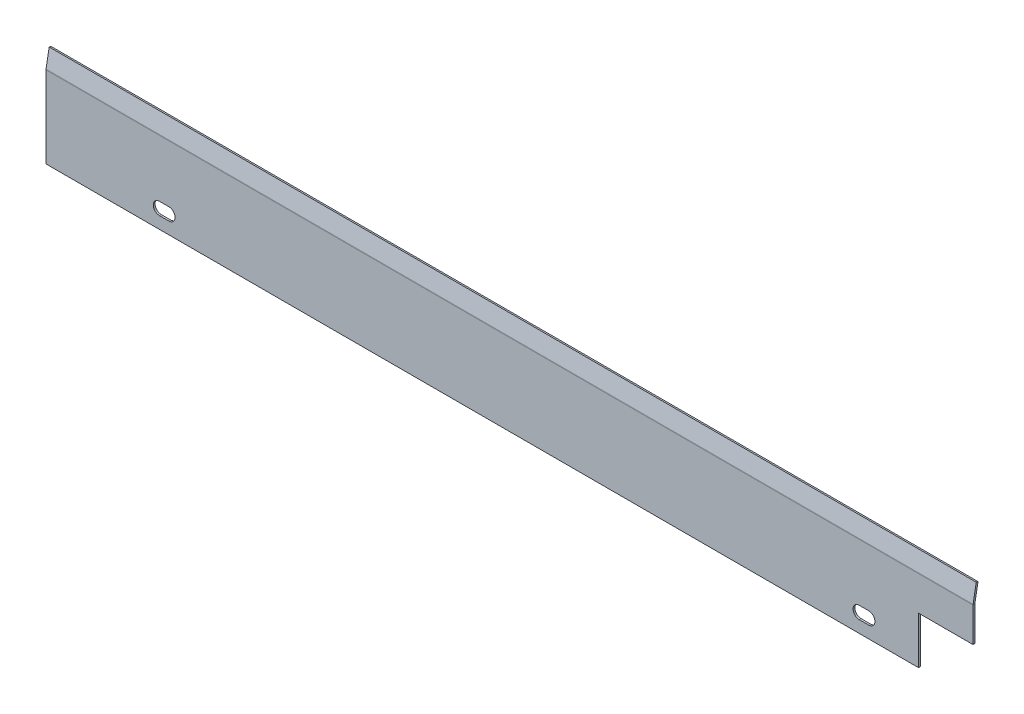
ISO-10303-21;
HEADER;
FILE_DESCRIPTION(('STEP AP214'),'2;1');
FILE_NAME('part.step','',(''),(''),'','','');
FILE_SCHEMA(('AUTOMOTIVE_DESIGN { 1 0 10303 214 1 1 1 1 }'));
ENDSEC;
DATA;
#1=APPLICATION_CONTEXT('core data for automotive mechanical design processes');
#2=APPLICATION_PROTOCOL_DEFINITION('international standard','automotive_design',2000,#1);
#3=PRODUCT_CONTEXT('',#1,'mechanical');
#4=PRODUCT('Part','Part','',(#3));
#5=PRODUCT_RELATED_PRODUCT_CATEGORY('part','',(#4));
#6=PRODUCT_DEFINITION_FORMATION('','',#4);
#7=PRODUCT_DEFINITION_CONTEXT('part definition',#1,'design');
#8=PRODUCT_DEFINITION('design','',#6,#7);
#9=PRODUCT_DEFINITION_SHAPE('','',#8);
#10=(LENGTH_UNIT() NAMED_UNIT(*) SI_UNIT(.MILLI.,.METRE.));
#11=(NAMED_UNIT(*) PLANE_ANGLE_UNIT() SI_UNIT($,.RADIAN.));
#12=(NAMED_UNIT(*) SI_UNIT($,.STERADIAN.) SOLID_ANGLE_UNIT());
#13=UNCERTAINTY_MEASURE_WITH_UNIT(LENGTH_MEASURE(1.E-05),#10,'distance_accuracy_value','');
#14=(GEOMETRIC_REPRESENTATION_CONTEXT(3) GLOBAL_UNCERTAINTY_ASSIGNED_CONTEXT((#13)) GLOBAL_UNIT_ASSIGNED_CONTEXT((#10,
#11,#12)) REPRESENTATION_CONTEXT('',''));
#15=CARTESIAN_POINT('',(0.,0.,0.));
#16=DIRECTION('',(0.,0.,1.));
#17=DIRECTION('',(1.,0.,0.));
#18=AXIS2_PLACEMENT_3D('',#15,#16,#17);
#19=CARTESIAN_POINT('',(255.,45.1723190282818,-0.0303844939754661));
#20=DIRECTION('',(1.,0.,0.));
#21=DIRECTION('',(0.,0.,-1.));
#22=AXIS2_PLACEMENT_3D('',#19,#20,#21);
#23=PLANE('',#22);
#24=DIRECTION('',(0.,-0.173648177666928,-0.984807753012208));
#25=VECTOR('',#24,1.);
#26=CARTESIAN_POINT('',(255.,45.1723190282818,-0.0303844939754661));
#27=LINE('',#26,#25);
#28=CARTESIAN_POINT('',(255.,45.1723190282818,-0.0303844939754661));
#29=VERTEX_POINT('',#28);
#30=CARTESIAN_POINT('',(255.,44.9986708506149,-1.01519224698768));
#31=VERTEX_POINT('',#30);
#32=EDGE_CURVE('E339',#29,#31,#27,.T.);
#33=ORIENTED_EDGE('',*,*,#32,.F.);
#34=CARTESIAN_POINT('',(255.,44.825022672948,-1.99999999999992));
#35=DIRECTION('',(1.,0.,0.));
#36=DIRECTION('',(0.,0.,-1.));
#37=AXIS2_PLACEMENT_3D('',#34,#35,#36);
#38=CIRCLE('',#37,2.);
#39=CARTESIAN_POINT('',(255.,44.825022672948,0.));
#40=VERTEX_POINT('',#39);
#41=EDGE_CURVE('E287',#40,#29,#38,.F.);
#42=ORIENTED_EDGE('',*,*,#41,.F.);
#43=DIRECTION('',(0.,0.,1.));
#44=VECTOR('',#43,1.);
#45=CARTESIAN_POINT('',(255.,44.825022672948,-0.999999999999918));
#46=LINE('',#45,#44);
#47=CARTESIAN_POINT('',(255.,44.825022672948,-0.999999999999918));
#48=VERTEX_POINT('',#47);
#49=EDGE_CURVE('E335',#48,#40,#46,.T.);
#50=ORIENTED_EDGE('',*,*,#49,.F.);
#51=CARTESIAN_POINT('',(255.,44.825022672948,-1.99999999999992));
#52=DIRECTION('',(1.,0.,0.));
#53=DIRECTION('',(0.,0.,-1.));
#54=AXIS2_PLACEMENT_3D('',#51,#52,#53);
#55=CIRCLE('',#54,1.);
#56=EDGE_CURVE('E297',#48,#31,#55,.F.);
#57=ORIENTED_EDGE('',*,*,#56,.T.);
#58=EDGE_LOOP('',(#33,#42,#50,#57));
#59=FACE_BOUND('',#58,.T.);
#60=ADVANCED_FACE('F38',(#59),#23,.T.);
#61=CARTESIAN_POINT('',(255.,44.825022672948,-0.999999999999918));
#62=DIRECTION('',(1.,0.,0.));
#63=DIRECTION('',(0.,0.,-1.));
#64=AXIS2_PLACEMENT_3D('',#61,#62,#63);
#65=PLANE('',#64);
#66=DIRECTION('',(0.,0.984807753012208,-0.17364817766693));
#67=VECTOR('',#66,1.);
#68=CARTESIAN_POINT('',(255.,45.,0.));
#69=LINE('',#68,#67);
#70=CARTESIAN_POINT('',(255.,54.8480775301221,-1.7364817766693));
#71=VERTEX_POINT('',#70);
#72=EDGE_CURVE('E283',#29,#71,#69,.T.);
#73=ORIENTED_EDGE('',*,*,#72,.F.);
#74=ORIENTED_EDGE('',*,*,#32,.T.);
#75=DIRECTION('',(0.,0.984807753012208,-0.17364817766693));
#76=VECTOR('',#75,1.);
#77=CARTESIAN_POINT('',(255.,44.8263518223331,-0.984807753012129));
#78=LINE('',#77,#76);
#79=CARTESIAN_POINT('',(255.,54.6744293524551,-2.72128952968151));
#80=VERTEX_POINT('',#79);
#81=EDGE_CURVE('E276',#31,#80,#78,.T.);
#82=ORIENTED_EDGE('',*,*,#81,.T.);
#83=DIRECTION('',(0.,-0.173648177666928,-0.984807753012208));
#84=VECTOR('',#83,1.);
#85=CARTESIAN_POINT('',(255.,54.8480775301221,-1.7364817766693));
#86=LINE('',#85,#84);
#87=EDGE_CURVE('E279',#71,#80,#86,.T.);
#88=ORIENTED_EDGE('',*,*,#87,.F.);
#89=EDGE_LOOP('',(#73,#74,#82,#88));
#90=FACE_BOUND('',#89,.T.);
#91=ADVANCED_FACE('F392',(#90),#65,.T.);
#92=CARTESIAN_POINT('',(-255.,44.8250226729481,0.));
#93=DIRECTION('',(-1.,0.,0.));
#94=DIRECTION('',(0.,0.,1.));
#95=AXIS2_PLACEMENT_3D('',#92,#93,#94);
#96=PLANE('',#95);
#97=DIRECTION('',(0.,0.,-1.));
#98=VECTOR('',#97,1.);
#99=CARTESIAN_POINT('',(-255.,44.8250226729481,0.));
#100=LINE('',#99,#98);
#101=CARTESIAN_POINT('',(-255.,44.8250226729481,0.));
#102=VERTEX_POINT('',#101);
#103=CARTESIAN_POINT('',(-255.,44.8250226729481,-0.999999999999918));
#104=VERTEX_POINT('',#103);
#105=EDGE_CURVE('E332',#102,#104,#100,.T.);
#106=ORIENTED_EDGE('',*,*,#105,.F.);
#107=CARTESIAN_POINT('',(-255.,44.8250226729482,-1.99999999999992));
#108=DIRECTION('',(1.,0.,0.));
#109=DIRECTION('',(0.,0.,-1.));
#110=AXIS2_PLACEMENT_3D('',#107,#108,#109);
#111=CIRCLE('',#110,2.);
#112=CARTESIAN_POINT('',(-255.,45.172319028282,-0.0303844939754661));
#113=VERTEX_POINT('',#112);
#114=EDGE_CURVE('E257',#102,#113,#111,.F.);
#115=ORIENTED_EDGE('',*,*,#114,.T.);
#116=DIRECTION('',(0.,0.173648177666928,0.984807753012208));
#117=VECTOR('',#116,1.);
#118=CARTESIAN_POINT('',(-255.,44.9986708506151,-1.01519224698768));
#119=LINE('',#118,#117);
#120=CARTESIAN_POINT('',(-255.,44.9986708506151,-1.01519224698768));
#121=VERTEX_POINT('',#120);
#122=EDGE_CURVE('E329',#121,#113,#119,.T.);
#123=ORIENTED_EDGE('',*,*,#122,.F.);
#124=CARTESIAN_POINT('',(-255.,44.8250226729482,-1.99999999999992));
#125=DIRECTION('',(1.,0.,0.));
#126=DIRECTION('',(0.,0.,-1.));
#127=AXIS2_PLACEMENT_3D('',#124,#125,#126);
#128=CIRCLE('',#127,1.);
#129=EDGE_CURVE('E272',#104,#121,#128,.F.);
#130=ORIENTED_EDGE('',*,*,#129,.F.);
#131=EDGE_LOOP('',(#106,#115,#123,#130));
#132=FACE_BOUND('',#131,.T.);
#133=ADVANCED_FACE('F397',(#132),#96,.T.);
#134=CARTESIAN_POINT('',(-255.,44.9986708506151,-1.01519224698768));
#135=DIRECTION('',(-1.,0.,0.));
#136=DIRECTION('',(0.,0.,1.));
#137=AXIS2_PLACEMENT_3D('',#134,#135,#136);
#138=PLANE('',#137);
#139=DIRECTION('',(0.,1.,0.));
#140=VECTOR('',#139,1.);
#141=CARTESIAN_POINT('',(-255.,1.66533453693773E-13,0.));
#142=LINE('',#141,#140);
#143=CARTESIAN_POINT('',(-255.,1.66533453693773E-13,0.));
#144=VERTEX_POINT('',#143);
#145=EDGE_CURVE('E261',#144,#102,#142,.T.);
#146=ORIENTED_EDGE('',*,*,#145,.T.);
#147=ORIENTED_EDGE('',*,*,#105,.T.);
#148=DIRECTION('',(0.,1.,0.));
#149=VECTOR('',#148,1.);
#150=CARTESIAN_POINT('',(-255.,1.66533453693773E-13,-1.));
#151=LINE('',#150,#149);
#152=CARTESIAN_POINT('',(-255.,1.66533453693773E-13,-1.));
#153=VERTEX_POINT('',#152);
#154=EDGE_CURVE('E268',#153,#104,#151,.T.);
#155=ORIENTED_EDGE('',*,*,#154,.F.);
#156=DIRECTION('',(0.,0.,1.));
#157=VECTOR('',#156,1.);
#158=CARTESIAN_POINT('',(-255.,1.66533453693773E-13,-1.));
#159=LINE('',#158,#157);
#160=EDGE_CURVE('E264',#153,#144,#159,.T.);
#161=ORIENTED_EDGE('',*,*,#160,.T.);
#162=EDGE_LOOP('',(#146,#147,#155,#161));
#163=FACE_BOUND('',#162,.T.);
#164=ADVANCED_FACE('F441',(#163),#138,.T.);
#165=CARTESIAN_POINT('',(255.,44.8263518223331,-0.984807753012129));
#166=DIRECTION('',(0.,0.17364817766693,0.984807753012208));
#167=DIRECTION('',(0.,-0.984807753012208,0.17364817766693));
#168=AXIS2_PLACEMENT_3D('',#165,#166,#167);
#169=PLANE('',#168);
#170=DIRECTION('',(0.,0.984807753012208,-0.17364817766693));
#171=VECTOR('',#170,1.);
#172=CARTESIAN_POINT('',(-255.,44.8263518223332,-0.984807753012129));
#173=LINE('',#172,#171);
#174=CARTESIAN_POINT('',(-255.,54.6744293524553,-2.72128952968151));
#175=VERTEX_POINT('',#174);
#176=EDGE_CURVE('E245',#121,#175,#173,.T.);
#177=ORIENTED_EDGE('',*,*,#176,.T.);
#178=DIRECTION('',(-1.,0.,0.));
#179=VECTOR('',#178,1.);
#180=CARTESIAN_POINT('',(255.,54.6744293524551,-2.72128952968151));
#181=LINE('',#180,#179);
#182=EDGE_CURVE('E326',#80,#175,#181,.T.);
#183=ORIENTED_EDGE('',*,*,#182,.F.);
#184=ORIENTED_EDGE('',*,*,#81,.F.);
#185=DIRECTION('',(-1.,0.,0.));
#186=VECTOR('',#185,1.);
#187=CARTESIAN_POINT('',(255.,44.9986708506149,-1.01519224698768));
#188=LINE('',#187,#186);
#189=EDGE_CURVE('E301',#31,#121,#188,.T.);
#190=ORIENTED_EDGE('',*,*,#189,.T.);
#191=EDGE_LOOP('',(#177,#183,#184,#190));
#192=FACE_BOUND('',#191,.T.);
#193=ADVANCED_FACE('F433',(#192),#169,.F.);
#194=CARTESIAN_POINT('',(255.,54.8480775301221,-1.7364817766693));
#195=DIRECTION('',(0.,0.984807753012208,-0.173648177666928));
#196=DIRECTION('',(0.,0.173648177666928,0.984807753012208));
#197=AXIS2_PLACEMENT_3D('',#194,#195,#196);
#198=PLANE('',#197);
#199=DIRECTION('',(0.,-0.173648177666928,-0.984807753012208));
#200=VECTOR('',#199,1.);
#201=CARTESIAN_POINT('',(-255.,54.8480775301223,-1.7364817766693));
#202=LINE('',#201,#200);
#203=CARTESIAN_POINT('',(-255.,54.8480775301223,-1.7364817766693));
#204=VERTEX_POINT('',#203);
#205=EDGE_CURVE('E249',#204,#175,#202,.T.);
#206=ORIENTED_EDGE('',*,*,#205,.F.);
#207=DIRECTION('',(-1.,0.,0.));
#208=VECTOR('',#207,1.);
#209=CARTESIAN_POINT('',(255.,54.8480775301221,-1.7364817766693));
#210=LINE('',#209,#208);
#211=EDGE_CURVE('E323',#71,#204,#210,.T.);
#212=ORIENTED_EDGE('',*,*,#211,.F.);
#213=ORIENTED_EDGE('',*,*,#87,.T.);
#214=ORIENTED_EDGE('',*,*,#182,.T.);
#215=EDGE_LOOP('',(#206,#212,#213,#214));
#216=FACE_BOUND('',#215,.T.);
#217=ADVANCED_FACE('F436',(#216),#198,.T.);
#218=CARTESIAN_POINT('',(255.,45.,0.));
#219=DIRECTION('',(0.,0.17364817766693,0.984807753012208));
#220=DIRECTION('',(0.,-0.984807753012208,0.17364817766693));
#221=AXIS2_PLACEMENT_3D('',#218,#219,#220);
#222=PLANE('',#221);
#223=DIRECTION('',(0.,0.984807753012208,-0.17364817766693));
#224=VECTOR('',#223,1.);
#225=CARTESIAN_POINT('',(-255.,45.0000000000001,0.));
#226=LINE('',#225,#224);
#227=EDGE_CURVE('E253',#113,#204,#226,.T.);
#228=ORIENTED_EDGE('',*,*,#227,.F.);
#229=DIRECTION('',(-1.,0.,0.));
#230=VECTOR('',#229,1.);
#231=CARTESIAN_POINT('',(255.,45.1723190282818,-0.0303844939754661));
#232=LINE('',#231,#230);
#233=EDGE_CURVE('E319',#29,#113,#232,.T.);
#234=ORIENTED_EDGE('',*,*,#233,.F.);
#235=ORIENTED_EDGE('',*,*,#72,.T.);
#236=ORIENTED_EDGE('',*,*,#211,.T.);
#237=EDGE_LOOP('',(#228,#234,#235,#236));
#238=FACE_BOUND('',#237,.T.);
#239=ADVANCED_FACE('F407',(#238),#222,.T.);
#240=CARTESIAN_POINT('',(255.,44.825022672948,-1.99999999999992));
#241=DIRECTION('',(-1.,0.,0.));
#242=DIRECTION('',(0.,0.,1.));
#243=AXIS2_PLACEMENT_3D('',#240,#241,#242);
#244=CYLINDRICAL_SURFACE('',#243,2.);
#245=ORIENTED_EDGE('',*,*,#114,.F.);
#246=DIRECTION('',(-1.,0.,0.));
#247=VECTOR('',#246,1.);
#248=CARTESIAN_POINT('',(255.,44.825022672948,0.));
#249=LINE('',#248,#247);
#250=EDGE_CURVE('E315',#40,#102,#249,.T.);
#251=ORIENTED_EDGE('',*,*,#250,.F.);
#252=ORIENTED_EDGE('',*,*,#41,.T.);
#253=ORIENTED_EDGE('',*,*,#233,.T.);
#254=EDGE_LOOP('',(#245,#251,#252,#253));
#255=FACE_BOUND('',#254,.T.);
#256=ADVANCED_FACE('F412',(#255),#244,.T.);
#257=CARTESIAN_POINT('',(255.,0.,0.));
#258=DIRECTION('',(0.,0.,1.));
#259=DIRECTION('',(1.,0.,0.));
#260=AXIS2_PLACEMENT_3D('',#257,#258,#259);
#261=PLANE('',#260);
#262=CARTESIAN_POINT('',(192.4,9.99999999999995,0.));
#263=DIRECTION('',(0.,0.,1.));
#264=DIRECTION('',(-1.,0.,0.));
#265=AXIS2_PLACEMENT_3D('',#262,#263,#264);
#266=CIRCLE('',#265,3.4);
#267=CARTESIAN_POINT('',(192.4,13.4,0.));
#268=VERTEX_POINT('',#267);
#269=CARTESIAN_POINT('',(192.4,6.59999999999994,0.));
#270=VERTEX_POINT('',#269);
#271=EDGE_CURVE('E53',#268,#270,#266,.T.);
#272=ORIENTED_EDGE('',*,*,#271,.F.);
#273=DIRECTION('',(-1.,0.,0.));
#274=VECTOR('',#273,1.);
#275=CARTESIAN_POINT('',(192.4,13.4,0.));
#276=LINE('',#275,#274);
#277=CARTESIAN_POINT('',(197.6,13.4,0.));
#278=VERTEX_POINT('',#277);
#279=EDGE_CURVE('E184',#278,#268,#276,.T.);
#280=ORIENTED_EDGE('',*,*,#279,.F.);
#281=CARTESIAN_POINT('',(197.6,9.99999999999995,0.));
#282=DIRECTION('',(0.,0.,1.));
#283=DIRECTION('',(1.,0.,0.));
#284=AXIS2_PLACEMENT_3D('',#281,#282,#283);
#285=CIRCLE('',#284,3.4);
#286=CARTESIAN_POINT('',(197.6,6.59999999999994,0.));
#287=VERTEX_POINT('',#286);
#288=EDGE_CURVE('E166',#287,#278,#285,.T.);
#289=ORIENTED_EDGE('',*,*,#288,.F.);
#290=DIRECTION('',(1.,0.,0.));
#291=VECTOR('',#290,1.);
#292=CARTESIAN_POINT('',(192.4,6.59999999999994,0.));
#293=LINE('',#292,#291);
#294=EDGE_CURVE('E176',#270,#287,#293,.T.);
#295=ORIENTED_EDGE('',*,*,#294,.F.);
#296=EDGE_LOOP('',(#272,#280,#289,#295));
#297=FACE_BOUND('',#296,.T.);
#298=CARTESIAN_POINT('',(-192.6,10.0000000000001,0.));
#299=DIRECTION('',(0.,0.,1.));
#300=DIRECTION('',(-1.,0.,0.));
#301=AXIS2_PLACEMENT_3D('',#298,#299,#300);
#302=CIRCLE('',#301,3.4);
#303=CARTESIAN_POINT('',(-192.6,13.4000000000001,0.));
#304=VERTEX_POINT('',#303);
#305=CARTESIAN_POINT('',(-192.6,6.60000000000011,0.));
#306=VERTEX_POINT('',#305);
#307=EDGE_CURVE('E196',#304,#306,#302,.T.);
#308=ORIENTED_EDGE('',*,*,#307,.F.);
#309=DIRECTION('',(-1.,0.,0.));
#310=VECTOR('',#309,1.);
#311=CARTESIAN_POINT('',(-192.6,13.4000000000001,0.));
#312=LINE('',#311,#310);
#313=CARTESIAN_POINT('',(-187.4,13.4000000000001,0.));
#314=VERTEX_POINT('',#313);
#315=EDGE_CURVE('E211',#314,#304,#312,.T.);
#316=ORIENTED_EDGE('',*,*,#315,.F.);
#317=CARTESIAN_POINT('',(-187.4,10.0000000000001,0.));
#318=DIRECTION('',(0.,0.,1.));
#319=DIRECTION('',(1.,0.,0.));
#320=AXIS2_PLACEMENT_3D('',#317,#318,#319);
#321=CIRCLE('',#320,3.4);
#322=CARTESIAN_POINT('',(-187.4,6.60000000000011,0.));
#323=VERTEX_POINT('',#322);
#324=EDGE_CURVE('E207',#323,#314,#321,.T.);
#325=ORIENTED_EDGE('',*,*,#324,.F.);
#326=DIRECTION('',(1.,0.,0.));
#327=VECTOR('',#326,1.);
#328=CARTESIAN_POINT('',(-192.6,6.60000000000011,0.));
#329=LINE('',#328,#327);
#330=EDGE_CURVE('E203',#306,#323,#329,.T.);
#331=ORIENTED_EDGE('',*,*,#330,.F.);
#332=EDGE_LOOP('',(#308,#316,#325,#331));
#333=FACE_BOUND('',#332,.T.);
#334=DIRECTION('',(0.,-1.,0.));
#335=VECTOR('',#334,1.);
#336=CARTESIAN_POINT('',(225.,0.,0.));
#337=LINE('',#336,#335);
#338=CARTESIAN_POINT('',(225.,26.,0.));
#339=VERTEX_POINT('',#338);
#340=CARTESIAN_POINT('',(225.,0.,0.));
#341=VERTEX_POINT('',#340);
#342=EDGE_CURVE('E231',#339,#341,#337,.T.);
#343=ORIENTED_EDGE('',*,*,#342,.F.);
#344=DIRECTION('',(-1.,0.,0.));
#345=VECTOR('',#344,1.);
#346=CARTESIAN_POINT('',(255.,26.,0.));
#347=LINE('',#346,#345);
#348=CARTESIAN_POINT('',(255.,26.,0.));
#349=VERTEX_POINT('',#348);
#350=EDGE_CURVE('E218',#349,#339,#347,.T.);
#351=ORIENTED_EDGE('',*,*,#350,.F.);
#352=DIRECTION('',(0.,1.,0.));
#353=VECTOR('',#352,1.);
#354=CARTESIAN_POINT('',(255.,0.,0.));
#355=LINE('',#354,#353);
#356=EDGE_CURVE('E291',#349,#40,#355,.T.);
#357=ORIENTED_EDGE('',*,*,#356,.T.);
#358=ORIENTED_EDGE('',*,*,#250,.T.);
#359=ORIENTED_EDGE('',*,*,#145,.F.);
#360=DIRECTION('',(-1.,0.,0.));
#361=VECTOR('',#360,1.);
#362=CARTESIAN_POINT('',(255.,0.,0.));
#363=LINE('',#362,#361);
#364=EDGE_CURVE('E312',#341,#144,#363,.T.);
#365=ORIENTED_EDGE('',*,*,#364,.F.);
#366=EDGE_LOOP('',(#343,#351,#357,#358,#359,#365));
#367=FACE_BOUND('',#366,.T.);
#368=ADVANCED_FACE('F181',(#297,#333,#367),#261,.T.);
#369=CARTESIAN_POINT('',(255.,0.,-1.));
#370=DIRECTION('',(0.,-1.,0.));
#371=DIRECTION('',(0.,0.,-1.));
#372=AXIS2_PLACEMENT_3D('',#369,#370,#371);
#373=PLANE('',#372);
#374=DIRECTION('',(0.,0.,1.));
#375=VECTOR('',#374,1.);
#376=CARTESIAN_POINT('',(225.,0.,-2.72128952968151));
#377=LINE('',#376,#375);
#378=CARTESIAN_POINT('',(225.,0.,-1.));
#379=VERTEX_POINT('',#378);
#380=EDGE_CURVE('E235',#379,#341,#377,.T.);
#381=ORIENTED_EDGE('',*,*,#380,.T.);
#382=ORIENTED_EDGE('',*,*,#364,.T.);
#383=ORIENTED_EDGE('',*,*,#160,.F.);
#384=DIRECTION('',(-1.,0.,0.));
#385=VECTOR('',#384,1.);
#386=CARTESIAN_POINT('',(255.,0.,-1.));
#387=LINE('',#386,#385);
#388=EDGE_CURVE('E309',#379,#153,#387,.T.);
#389=ORIENTED_EDGE('',*,*,#388,.F.);
#390=EDGE_LOOP('',(#381,#382,#383,#389));
#391=FACE_BOUND('',#390,.T.);
#392=ADVANCED_FACE('F445',(#391),#373,.T.);
#393=CARTESIAN_POINT('',(255.,0.,-1.));
#394=DIRECTION('',(0.,0.,1.));
#395=DIRECTION('',(1.,0.,0.));
#396=AXIS2_PLACEMENT_3D('',#393,#394,#395);
#397=PLANE('',#396);
#398=DIRECTION('',(-1.,0.,0.));
#399=VECTOR('',#398,1.);
#400=CARTESIAN_POINT('',(255.,13.3999999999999,-1.));
#401=LINE('',#400,#399);
#402=CARTESIAN_POINT('',(197.6,13.4,-1.));
#403=VERTEX_POINT('',#402);
#404=CARTESIAN_POINT('',(192.4,13.4,-1.));
#405=VERTEX_POINT('',#404);
#406=EDGE_CURVE('E46',#403,#405,#401,.T.);
#407=ORIENTED_EDGE('',*,*,#406,.T.);
#408=CARTESIAN_POINT('',(192.4,9.99999999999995,-1.));
#409=DIRECTION('',(0.,0.,1.));
#410=DIRECTION('',(1.,0.,0.));
#411=AXIS2_PLACEMENT_3D('',#408,#409,#410);
#412=CIRCLE('',#411,3.4);
#413=CARTESIAN_POINT('',(192.4,6.59999999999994,-1.));
#414=VERTEX_POINT('',#413);
#415=EDGE_CURVE('E11',#405,#414,#412,.T.);
#416=ORIENTED_EDGE('',*,*,#415,.T.);
#417=DIRECTION('',(1.,0.,0.));
#418=VECTOR('',#417,1.);
#419=CARTESIAN_POINT('',(255.,6.59999999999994,-1.));
#420=LINE('',#419,#418);
#421=CARTESIAN_POINT('',(197.6,6.59999999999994,-1.));
#422=VERTEX_POINT('',#421);
#423=EDGE_CURVE('E365',#414,#422,#420,.T.);
#424=ORIENTED_EDGE('',*,*,#423,.T.);
#425=CARTESIAN_POINT('',(197.6,9.99999999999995,-1.));
#426=DIRECTION('',(0.,0.,1.));
#427=DIRECTION('',(1.,0.,0.));
#428=AXIS2_PLACEMENT_3D('',#425,#426,#427);
#429=CIRCLE('',#428,3.4);
#430=EDGE_CURVE('E169',#422,#403,#429,.T.);
#431=ORIENTED_EDGE('',*,*,#430,.T.);
#432=EDGE_LOOP('',(#407,#416,#424,#431));
#433=FACE_BOUND('',#432,.T.);
#434=DIRECTION('',(-1.,0.,0.));
#435=VECTOR('',#434,1.);
#436=CARTESIAN_POINT('',(255.,13.3999999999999,-1.));
#437=LINE('',#436,#435);
#438=CARTESIAN_POINT('',(-187.4,13.4000000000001,-0.999999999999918));
#439=VERTEX_POINT('',#438);
#440=CARTESIAN_POINT('',(-192.6,13.4000000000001,-0.999999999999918));
#441=VERTEX_POINT('',#440);
#442=EDGE_CURVE('E357',#439,#441,#437,.T.);
#443=ORIENTED_EDGE('',*,*,#442,.T.);
#444=CARTESIAN_POINT('',(-192.6,10.0000000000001,-0.999999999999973));
#445=DIRECTION('',(0.,0.,1.));
#446=DIRECTION('',(1.,0.,0.));
#447=AXIS2_PLACEMENT_3D('',#444,#445,#446);
#448=CIRCLE('',#447,3.4);
#449=CARTESIAN_POINT('',(-192.6,6.60000000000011,-1.));
#450=VERTEX_POINT('',#449);
#451=EDGE_CURVE('E361',#441,#450,#448,.T.);
#452=ORIENTED_EDGE('',*,*,#451,.T.);
#453=DIRECTION('',(1.,0.,0.));
#454=VECTOR('',#453,1.);
#455=CARTESIAN_POINT('',(255.,6.59999999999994,-1.));
#456=LINE('',#455,#454);
#457=CARTESIAN_POINT('',(-187.4,6.60000000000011,-1.));
#458=VERTEX_POINT('',#457);
#459=EDGE_CURVE('E349',#450,#458,#456,.T.);
#460=ORIENTED_EDGE('',*,*,#459,.T.);
#461=CARTESIAN_POINT('',(-187.4,10.0000000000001,-0.999999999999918));
#462=DIRECTION('',(0.,0.,1.));
#463=DIRECTION('',(1.,0.,0.));
#464=AXIS2_PLACEMENT_3D('',#461,#462,#463);
#465=CIRCLE('',#464,3.4);
#466=EDGE_CURVE('E353',#458,#439,#465,.T.);
#467=ORIENTED_EDGE('',*,*,#466,.T.);
#468=EDGE_LOOP('',(#443,#452,#460,#467));
#469=FACE_BOUND('',#468,.T.);
#470=DIRECTION('',(-1.,0.,0.));
#471=VECTOR('',#470,1.);
#472=CARTESIAN_POINT('',(255.,26.,-1.));
#473=LINE('',#472,#471);
#474=CARTESIAN_POINT('',(255.,26.,-1.));
#475=VERTEX_POINT('',#474);
#476=CARTESIAN_POINT('',(225.,26.,-1.));
#477=VERTEX_POINT('',#476);
#478=EDGE_CURVE('E239',#475,#477,#473,.T.);
#479=ORIENTED_EDGE('',*,*,#478,.T.);
#480=DIRECTION('',(0.,-1.,0.));
#481=VECTOR('',#480,1.);
#482=CARTESIAN_POINT('',(225.,0.,-1.));
#483=LINE('',#482,#481);
#484=EDGE_CURVE('E345',#477,#379,#483,.T.);
#485=ORIENTED_EDGE('',*,*,#484,.T.);
#486=ORIENTED_EDGE('',*,*,#388,.T.);
#487=ORIENTED_EDGE('',*,*,#154,.T.);
#488=DIRECTION('',(-1.,0.,0.));
#489=VECTOR('',#488,1.);
#490=CARTESIAN_POINT('',(255.,44.825022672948,-0.999999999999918));
#491=LINE('',#490,#489);
#492=EDGE_CURVE('E305',#48,#104,#491,.T.);
#493=ORIENTED_EDGE('',*,*,#492,.F.);
#494=DIRECTION('',(0.,1.,0.));
#495=VECTOR('',#494,1.);
#496=CARTESIAN_POINT('',(255.,0.,-1.));
#497=LINE('',#496,#495);
#498=EDGE_CURVE('E294',#475,#48,#497,.T.);
#499=ORIENTED_EDGE('',*,*,#498,.F.);
#500=EDGE_LOOP('',(#479,#485,#486,#487,#493,#499));
#501=FACE_BOUND('',#500,.T.);
#502=ADVANCED_FACE('F372',(#433,#469,#501),#397,.F.);
#503=CARTESIAN_POINT('',(255.,44.825022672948,-1.99999999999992));
#504=DIRECTION('',(-1.,0.,0.));
#505=DIRECTION('',(0.,0.,1.));
#506=AXIS2_PLACEMENT_3D('',#503,#504,#505);
#507=CYLINDRICAL_SURFACE('',#506,1.);
#508=ORIENTED_EDGE('',*,*,#129,.T.);
#509=ORIENTED_EDGE('',*,*,#189,.F.);
#510=ORIENTED_EDGE('',*,*,#56,.F.);
#511=ORIENTED_EDGE('',*,*,#492,.T.);
#512=EDGE_LOOP('',(#508,#509,#510,#511));
#513=FACE_BOUND('',#512,.T.);
#514=ADVANCED_FACE('F428',(#513),#507,.F.);
#515=CARTESIAN_POINT('',(255.,44.825022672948,-1.99999999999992));
#516=DIRECTION('',(1.,0.,0.));
#517=DIRECTION('',(0.,0.,-1.));
#518=AXIS2_PLACEMENT_3D('',#515,#516,#517);
#519=PLANE('',#518);
#520=DIRECTION('',(0.,0.,1.));
#521=VECTOR('',#520,1.);
#522=CARTESIAN_POINT('',(255.,26.,-1.99999999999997));
#523=LINE('',#522,#521);
#524=EDGE_CURVE('E342',#475,#349,#523,.T.);
#525=ORIENTED_EDGE('',*,*,#524,.F.);
#526=ORIENTED_EDGE('',*,*,#498,.T.);
#527=ORIENTED_EDGE('',*,*,#49,.T.);
#528=ORIENTED_EDGE('',*,*,#356,.F.);
#529=EDGE_LOOP('',(#525,#526,#527,#528));
#530=FACE_BOUND('',#529,.T.);
#531=ADVANCED_FACE('F421',(#530),#519,.T.);
#532=CARTESIAN_POINT('',(-255.,44.8250226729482,-1.99999999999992));
#533=DIRECTION('',(1.,0.,0.));
#534=DIRECTION('',(0.,0.,-1.));
#535=AXIS2_PLACEMENT_3D('',#532,#533,#534);
#536=PLANE('',#535);
#537=ORIENTED_EDGE('',*,*,#176,.F.);
#538=ORIENTED_EDGE('',*,*,#122,.T.);
#539=ORIENTED_EDGE('',*,*,#227,.T.);
#540=ORIENTED_EDGE('',*,*,#205,.T.);
#541=EDGE_LOOP('',(#537,#538,#539,#540));
#542=FACE_BOUND('',#541,.T.);
#543=ADVANCED_FACE('F438',(#542),#536,.F.);
#544=CARTESIAN_POINT('',(225.,0.,-2.72128952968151));
#545=DIRECTION('',(-1.,0.,0.));
#546=DIRECTION('',(0.,0.,1.));
#547=AXIS2_PLACEMENT_3D('',#544,#545,#546);
#548=PLANE('',#547);
#549=DIRECTION('',(0.,0.,1.));
#550=VECTOR('',#549,1.);
#551=CARTESIAN_POINT('',(225.,26.,-2.72128952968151));
#552=LINE('',#551,#550);
#553=EDGE_CURVE('E234',#477,#339,#552,.T.);
#554=ORIENTED_EDGE('',*,*,#553,.T.);
#555=ORIENTED_EDGE('',*,*,#342,.T.);
#556=ORIENTED_EDGE('',*,*,#380,.F.);
#557=ORIENTED_EDGE('',*,*,#484,.F.);
#558=EDGE_LOOP('',(#554,#555,#556,#557));
#559=FACE_BOUND('',#558,.T.);
#560=ADVANCED_FACE('F447',(#559),#548,.F.);
#561=CARTESIAN_POINT('',(255.,26.,-2.72128952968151));
#562=DIRECTION('',(0.,1.,0.));
#563=DIRECTION('',(0.,0.,1.));
#564=AXIS2_PLACEMENT_3D('',#561,#562,#563);
#565=PLANE('',#564);
#566=ORIENTED_EDGE('',*,*,#524,.T.);
#567=ORIENTED_EDGE('',*,*,#350,.T.);
#568=ORIENTED_EDGE('',*,*,#553,.F.);
#569=ORIENTED_EDGE('',*,*,#478,.F.);
#570=EDGE_LOOP('',(#566,#567,#568,#569));
#571=FACE_BOUND('',#570,.T.);
#572=ADVANCED_FACE('F450',(#571),#565,.F.);
#573=CARTESIAN_POINT('',(-192.6,10.0000000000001,-2.72128952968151));
#574=DIRECTION('',(0.,0.,1.));
#575=DIRECTION('',(1.,0.,0.));
#576=AXIS2_PLACEMENT_3D('',#573,#574,#575);
#577=CYLINDRICAL_SURFACE('',#576,3.4);
#578=DIRECTION('',(0.,0.,1.));
#579=VECTOR('',#578,1.);
#580=CARTESIAN_POINT('',(-192.6,13.4000000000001,-2.72128952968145));
#581=LINE('',#580,#579);
#582=EDGE_CURVE('E216',#441,#304,#581,.T.);
#583=ORIENTED_EDGE('',*,*,#582,.T.);
#584=ORIENTED_EDGE('',*,*,#307,.T.);
#585=DIRECTION('',(0.,0.,1.));
#586=VECTOR('',#585,1.);
#587=CARTESIAN_POINT('',(-192.6,6.60000000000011,-2.72128952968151));
#588=LINE('',#587,#586);
#589=EDGE_CURVE('E215',#450,#306,#588,.T.);
#590=ORIENTED_EDGE('',*,*,#589,.F.);
#591=ORIENTED_EDGE('',*,*,#451,.F.);
#592=EDGE_LOOP('',(#583,#584,#590,#591));
#593=FACE_BOUND('',#592,.T.);
#594=ADVANCED_FACE('F452',(#593),#577,.F.);
#595=CARTESIAN_POINT('',(-192.6,13.4000000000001,-2.72128952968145));
#596=DIRECTION('',(0.,1.,0.));
#597=DIRECTION('',(0.,0.,1.));
#598=AXIS2_PLACEMENT_3D('',#595,#596,#597);
#599=PLANE('',#598);
#600=DIRECTION('',(0.,0.,1.));
#601=VECTOR('',#600,1.);
#602=CARTESIAN_POINT('',(-187.4,13.4000000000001,-2.72128952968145));
#603=LINE('',#602,#601);
#604=EDGE_CURVE('E219',#439,#314,#603,.T.);
#605=ORIENTED_EDGE('',*,*,#604,.T.);
#606=ORIENTED_EDGE('',*,*,#315,.T.);
#607=ORIENTED_EDGE('',*,*,#582,.F.);
#608=ORIENTED_EDGE('',*,*,#442,.F.);
#609=EDGE_LOOP('',(#605,#606,#607,#608));
#610=FACE_BOUND('',#609,.T.);
#611=ADVANCED_FACE('F458',(#610),#599,.F.);
#612=CARTESIAN_POINT('',(-187.4,10.0000000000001,-2.72128952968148));
#613=DIRECTION('',(0.,0.,1.));
#614=DIRECTION('',(1.,0.,0.));
#615=AXIS2_PLACEMENT_3D('',#612,#613,#614);
#616=CYLINDRICAL_SURFACE('',#615,3.4);
#617=DIRECTION('',(0.,0.,1.));
#618=VECTOR('',#617,1.);
#619=CARTESIAN_POINT('',(-187.4,6.60000000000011,-2.72128952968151));
#620=LINE('',#619,#618);
#621=EDGE_CURVE('E222',#458,#323,#620,.T.);
#622=ORIENTED_EDGE('',*,*,#621,.T.);
#623=ORIENTED_EDGE('',*,*,#324,.T.);
#624=ORIENTED_EDGE('',*,*,#604,.F.);
#625=ORIENTED_EDGE('',*,*,#466,.F.);
#626=EDGE_LOOP('',(#622,#623,#624,#625));
#627=FACE_BOUND('',#626,.T.);
#628=ADVANCED_FACE('F386',(#627),#616,.F.);
#629=CARTESIAN_POINT('',(-192.6,6.60000000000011,-2.72128952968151));
#630=DIRECTION('',(0.,-1.,0.));
#631=DIRECTION('',(0.,0.,-1.));
#632=AXIS2_PLACEMENT_3D('',#629,#630,#631);
#633=PLANE('',#632);
#634=ORIENTED_EDGE('',*,*,#589,.T.);
#635=ORIENTED_EDGE('',*,*,#330,.T.);
#636=ORIENTED_EDGE('',*,*,#621,.F.);
#637=ORIENTED_EDGE('',*,*,#459,.F.);
#638=EDGE_LOOP('',(#634,#635,#636,#637));
#639=FACE_BOUND('',#638,.T.);
#640=ADVANCED_FACE('F379',(#639),#633,.F.);
#641=CARTESIAN_POINT('',(192.4,9.99999999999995,-2.72128952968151));
#642=DIRECTION('',(0.,0.,1.));
#643=DIRECTION('',(1.,0.,0.));
#644=AXIS2_PLACEMENT_3D('',#641,#642,#643);
#645=CYLINDRICAL_SURFACE('',#644,3.4);
#646=DIRECTION('',(0.,0.,1.));
#647=VECTOR('',#646,1.);
#648=CARTESIAN_POINT('',(192.4,13.4,-2.72128952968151));
#649=LINE('',#648,#647);
#650=EDGE_CURVE('E193',#405,#268,#649,.T.);
#651=ORIENTED_EDGE('',*,*,#650,.T.);
#652=ORIENTED_EDGE('',*,*,#271,.T.);
#653=DIRECTION('',(0.,0.,1.));
#654=VECTOR('',#653,1.);
#655=CARTESIAN_POINT('',(192.4,6.59999999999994,-2.72128952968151));
#656=LINE('',#655,#654);
#657=EDGE_CURVE('E173',#414,#270,#656,.T.);
#658=ORIENTED_EDGE('',*,*,#657,.F.);
#659=ORIENTED_EDGE('',*,*,#415,.F.);
#660=EDGE_LOOP('',(#651,#652,#658,#659));
#661=FACE_BOUND('',#660,.T.);
#662=ADVANCED_FACE('F377',(#661),#645,.F.);
#663=CARTESIAN_POINT('',(192.4,13.4,-2.72128952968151));
#664=DIRECTION('',(0.,1.,0.));
#665=DIRECTION('',(0.,0.,1.));
#666=AXIS2_PLACEMENT_3D('',#663,#664,#665);
#667=PLANE('',#666);
#668=DIRECTION('',(0.,0.,1.));
#669=VECTOR('',#668,1.);
#670=CARTESIAN_POINT('',(197.6,13.4,-2.72128952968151));
#671=LINE('',#670,#669);
#672=EDGE_CURVE('E172',#403,#278,#671,.T.);
#673=ORIENTED_EDGE('',*,*,#672,.T.);
#674=ORIENTED_EDGE('',*,*,#279,.T.);
#675=ORIENTED_EDGE('',*,*,#650,.F.);
#676=ORIENTED_EDGE('',*,*,#406,.F.);
#677=EDGE_LOOP('',(#673,#674,#675,#676));
#678=FACE_BOUND('',#677,.T.);
#679=ADVANCED_FACE('F376',(#678),#667,.F.);
#680=CARTESIAN_POINT('',(197.6,9.99999999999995,-2.72128952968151));
#681=DIRECTION('',(0.,0.,1.));
#682=DIRECTION('',(1.,0.,0.));
#683=AXIS2_PLACEMENT_3D('',#680,#681,#682);
#684=CYLINDRICAL_SURFACE('',#683,3.4);
#685=DIRECTION('',(0.,0.,1.));
#686=VECTOR('',#685,1.);
#687=CARTESIAN_POINT('',(197.6,6.59999999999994,-2.72128952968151));
#688=LINE('',#687,#686);
#689=EDGE_CURVE('E61',#422,#287,#688,.T.);
#690=ORIENTED_EDGE('',*,*,#689,.T.);
#691=ORIENTED_EDGE('',*,*,#288,.T.);
#692=ORIENTED_EDGE('',*,*,#672,.F.);
#693=ORIENTED_EDGE('',*,*,#430,.F.);
#694=EDGE_LOOP('',(#690,#691,#692,#693));
#695=FACE_BOUND('',#694,.T.);
#696=ADVANCED_FACE('F163',(#695),#684,.F.);
#697=CARTESIAN_POINT('',(192.4,6.59999999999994,-2.72128952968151));
#698=DIRECTION('',(0.,-1.,0.));
#699=DIRECTION('',(0.,0.,-1.));
#700=AXIS2_PLACEMENT_3D('',#697,#698,#699);
#701=PLANE('',#700);
#702=ORIENTED_EDGE('',*,*,#657,.T.);
#703=ORIENTED_EDGE('',*,*,#294,.T.);
#704=ORIENTED_EDGE('',*,*,#689,.F.);
#705=ORIENTED_EDGE('',*,*,#423,.F.);
#706=EDGE_LOOP('',(#702,#703,#704,#705));
#707=FACE_BOUND('',#706,.T.);
#708=ADVANCED_FACE('F177',(#707),#701,.F.);
#709=CLOSED_SHELL('',(#60,#91,#133,#164,#193,#217,#239,#256,#368,#392,#502,#514,#531,#543,#560,
#572,#594,#611,#628,#640,#662,#679,#696,#708));
#710=MANIFOLD_SOLID_BREP('B2',#709);
#711=ADVANCED_BREP_SHAPE_REPRESENTATION('',(#18,#710),#14);
#712=SHAPE_DEFINITION_REPRESENTATION(#9,#711);
ENDSEC;
END-ISO-10303-21;
